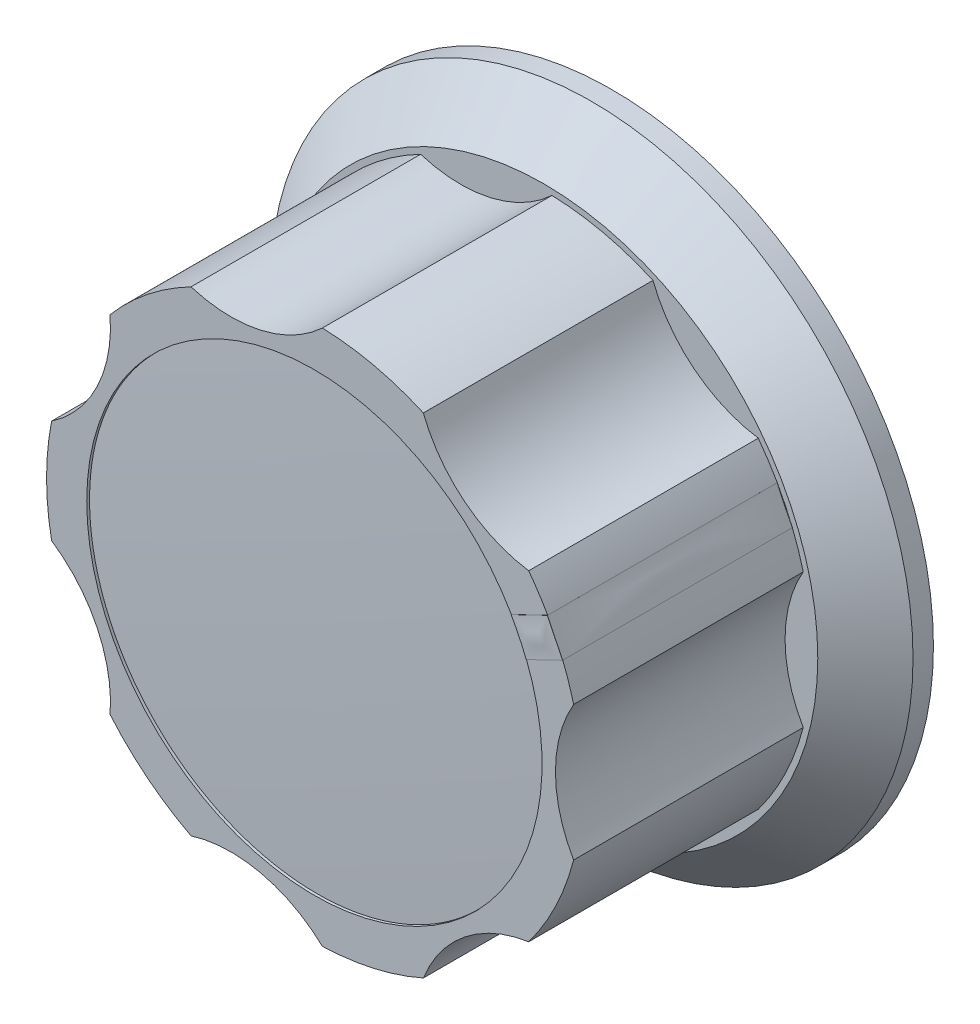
ISO-10303-21;
HEADER;
FILE_DESCRIPTION(('STEP AP214'),'2;1');
FILE_NAME('part.step','',(''),(''),'','','');
FILE_SCHEMA(('AUTOMOTIVE_DESIGN { 1 0 10303 214 1 1 1 1 }'));
ENDSEC;
DATA;
#1=APPLICATION_CONTEXT('core data for automotive mechanical design processes');
#2=APPLICATION_PROTOCOL_DEFINITION('international standard','automotive_design',2000,#1);
#3=PRODUCT_CONTEXT('',#1,'mechanical');
#4=PRODUCT('Part','Part','',(#3));
#5=PRODUCT_RELATED_PRODUCT_CATEGORY('part','',(#4));
#6=PRODUCT_DEFINITION_FORMATION('','',#4);
#7=PRODUCT_DEFINITION_CONTEXT('part definition',#1,'design');
#8=PRODUCT_DEFINITION('design','',#6,#7);
#9=PRODUCT_DEFINITION_SHAPE('','',#8);
#10=(LENGTH_UNIT() NAMED_UNIT(*) SI_UNIT(.MILLI.,.METRE.));
#11=(NAMED_UNIT(*) PLANE_ANGLE_UNIT() SI_UNIT($,.RADIAN.));
#12=(NAMED_UNIT(*) SI_UNIT($,.STERADIAN.) SOLID_ANGLE_UNIT());
#13=UNCERTAINTY_MEASURE_WITH_UNIT(LENGTH_MEASURE(1.E-05),#10,'distance_accuracy_value','');
#14=(GEOMETRIC_REPRESENTATION_CONTEXT(3) GLOBAL_UNCERTAINTY_ASSIGNED_CONTEXT((#13)) GLOBAL_UNIT_ASSIGNED_CONTEXT((#10,
#11,#12)) REPRESENTATION_CONTEXT('',''));
#15=CARTESIAN_POINT('',(0.,0.,0.));
#16=DIRECTION('',(0.,0.,1.));
#17=DIRECTION('',(1.,0.,0.));
#18=AXIS2_PLACEMENT_3D('',#15,#16,#17);
#19=CARTESIAN_POINT('',(8.70865108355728,4.91552004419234,11.1225));
#20=DIRECTION('',(-0.901009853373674,-0.433798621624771,0.));
#21=DIRECTION('',(0.433798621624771,-0.901009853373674,0.));
#22=AXIS2_PLACEMENT_3D('',#19,#20,#21);
#23=PLANE('',#22);
#24=DIRECTION('',(-0.433798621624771,0.901009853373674,0.));
#25=VECTOR('',#24,1.);
#26=CARTESIAN_POINT('',(8.70865108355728,4.91552004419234,11.1125));
#27=LINE('',#26,#25);
#28=CARTESIAN_POINT('',(9.27258929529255,3.74420722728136,11.1125));
#29=VERTEX_POINT('',#28);
#30=CARTESIAN_POINT('',(8.70865108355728,4.91552004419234,11.1125));
#31=VERTEX_POINT('',#30);
#32=EDGE_CURVE('E100',#29,#31,#27,.T.);
#33=ORIENTED_EDGE('',*,*,#32,.T.);
#34=DIRECTION('',(0.,0.,-1.));
#35=VECTOR('',#34,1.);
#36=CARTESIAN_POINT('',(8.70865108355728,4.91552004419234,11.1225));
#37=LINE('',#36,#35);
#38=CARTESIAN_POINT('',(8.70865108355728,4.91552004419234,11.1225));
#39=VERTEX_POINT('',#38);
#40=EDGE_CURVE('E12',#39,#31,#37,.T.);
#41=ORIENTED_EDGE('',*,*,#40,.F.);
#42=DIRECTION('',(-0.433798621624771,0.901009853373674,0.));
#43=VECTOR('',#42,1.);
#44=CARTESIAN_POINT('',(8.70865108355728,4.91552004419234,11.1225));
#45=LINE('',#44,#43);
#46=CARTESIAN_POINT('',(9.27258929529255,3.74420722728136,11.1225));
#47=VERTEX_POINT('',#46);
#48=EDGE_CURVE('E111',#47,#39,#45,.T.);
#49=ORIENTED_EDGE('',*,*,#48,.F.);
#50=DIRECTION('',(0.,0.,-1.));
#51=VECTOR('',#50,1.);
#52=CARTESIAN_POINT('',(9.27258929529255,3.74420722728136,11.1225));
#53=LINE('',#52,#51);
#54=EDGE_CURVE('E106',#47,#29,#53,.T.);
#55=ORIENTED_EDGE('',*,*,#54,.T.);
#56=EDGE_LOOP('',(#33,#41,#49,#55));
#57=FACE_BOUND('',#56,.T.);
#58=ADVANCED_FACE('F44',(#57),#23,.F.);
#59=CARTESIAN_POINT('',(7.35370589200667,4.26298131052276,11.1225));
#60=DIRECTION('',(0.433900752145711,-0.900960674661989,0.));
#61=DIRECTION('',(0.900960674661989,0.433900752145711,0.));
#62=AXIS2_PLACEMENT_3D('',#59,#60,#61);
#63=PLANE('',#62);
#64=DIRECTION('',(-0.900960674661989,-0.433900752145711,0.));
#65=VECTOR('',#64,1.);
#66=CARTESIAN_POINT('',(7.35370589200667,4.26298131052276,11.1125));
#67=LINE('',#66,#65);
#68=CARTESIAN_POINT('',(7.35370589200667,4.26298131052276,11.1125));
#69=VERTEX_POINT('',#68);
#70=EDGE_CURVE('E97',#31,#69,#67,.T.);
#71=ORIENTED_EDGE('',*,*,#70,.T.);
#72=DIRECTION('',(0.,0.,-1.));
#73=VECTOR('',#72,1.);
#74=CARTESIAN_POINT('',(7.35370589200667,4.26298131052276,11.1225));
#75=LINE('',#74,#73);
#76=CARTESIAN_POINT('',(7.35370589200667,4.26298131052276,11.1225));
#77=VERTEX_POINT('',#76);
#78=EDGE_CURVE('E56',#77,#69,#75,.T.);
#79=ORIENTED_EDGE('',*,*,#78,.F.);
#80=DIRECTION('',(-0.900960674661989,-0.433900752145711,0.));
#81=VECTOR('',#80,1.);
#82=CARTESIAN_POINT('',(7.35370589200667,4.26298131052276,11.1225));
#83=LINE('',#82,#81);
#84=EDGE_CURVE('E50',#39,#77,#83,.T.);
#85=ORIENTED_EDGE('',*,*,#84,.F.);
#86=ORIENTED_EDGE('',*,*,#40,.T.);
#87=EDGE_LOOP('',(#71,#79,#85,#86));
#88=FACE_BOUND('',#87,.T.);
#89=ADVANCED_FACE('F103',(#88),#63,.F.);
#90=CARTESIAN_POINT('',(0.,0.,11.1225));
#91=DIRECTION('',(0.,0.,-1.));
#92=DIRECTION('',(-1.,0.,0.));
#93=AXIS2_PLACEMENT_3D('',#90,#91,#92);
#94=CYLINDRICAL_SURFACE('',#93,8.5);
#95=CARTESIAN_POINT('',(0.,0.,11.1125));
#96=DIRECTION('',(0.,0.,-1.));
#97=DIRECTION('',(-1.,0.,0.));
#98=AXIS2_PLACEMENT_3D('',#95,#96,#97);
#99=CIRCLE('',#98,8.5);
#100=CARTESIAN_POINT('',(7.91777686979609,3.09173243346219,11.1125));
#101=VERTEX_POINT('',#100);
#102=EDGE_CURVE('E89',#69,#101,#99,.T.);
#103=ORIENTED_EDGE('',*,*,#102,.T.);
#104=DIRECTION('',(0.,0.,-1.));
#105=VECTOR('',#104,1.);
#106=CARTESIAN_POINT('',(7.91777686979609,3.09173243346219,11.1225));
#107=LINE('',#106,#105);
#108=CARTESIAN_POINT('',(7.91777686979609,3.09173243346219,11.1225));
#109=VERTEX_POINT('',#108);
#110=EDGE_CURVE('E113',#109,#101,#107,.T.);
#111=ORIENTED_EDGE('',*,*,#110,.F.);
#112=CARTESIAN_POINT('',(0.,0.,11.1225));
#113=DIRECTION('',(0.,0.,-1.));
#114=DIRECTION('',(-1.,0.,0.));
#115=AXIS2_PLACEMENT_3D('',#112,#113,#114);
#116=CIRCLE('',#115,8.5);
#117=EDGE_CURVE('E117',#77,#109,#116,.T.);
#118=ORIENTED_EDGE('',*,*,#117,.F.);
#119=ORIENTED_EDGE('',*,*,#78,.T.);
#120=EDGE_LOOP('',(#103,#111,#118,#119));
#121=FACE_BOUND('',#120,.T.);
#122=ADVANCED_FACE('F119',(#121),#94,.F.);
#123=CARTESIAN_POINT('',(7.91777686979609,3.09173243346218,11.1225));
#124=DIRECTION('',(-0.433900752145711,0.900960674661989,0.));
#125=DIRECTION('',(-0.900960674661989,-0.433900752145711,0.));
#126=AXIS2_PLACEMENT_3D('',#123,#124,#125);
#127=PLANE('',#126);
#128=DIRECTION('',(0.900960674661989,0.433900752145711,0.));
#129=VECTOR('',#128,1.);
#130=CARTESIAN_POINT('',(7.91777686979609,3.09173243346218,11.1125));
#131=LINE('',#130,#129);
#132=EDGE_CURVE('E81',#101,#29,#131,.T.);
#133=ORIENTED_EDGE('',*,*,#132,.T.);
#134=ORIENTED_EDGE('',*,*,#54,.F.);
#135=DIRECTION('',(0.900960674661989,0.433900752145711,0.));
#136=VECTOR('',#135,1.);
#137=CARTESIAN_POINT('',(7.91777686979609,3.09173243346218,11.1225));
#138=LINE('',#137,#136);
#139=EDGE_CURVE('E65',#109,#47,#138,.T.);
#140=ORIENTED_EDGE('',*,*,#139,.F.);
#141=ORIENTED_EDGE('',*,*,#110,.T.);
#142=EDGE_LOOP('',(#133,#134,#140,#141));
#143=FACE_BOUND('',#142,.T.);
#144=ADVANCED_FACE('F120',(#143),#127,.F.);
#145=CARTESIAN_POINT('',(8.70865108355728,4.91552004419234,11.1225));
#146=CARTESIAN_POINT('',(8.25700268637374,4.69800713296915,11.1225));
#147=CARTESIAN_POINT('',(7.80535428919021,4.48049422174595,11.1225));
#148=CARTESIAN_POINT('',(7.35370589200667,4.26298131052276,11.1225));
#149=CARTESIAN_POINT('',(8.89663048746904,4.52508243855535,11.1225));
#150=CARTESIAN_POINT('',(8.45663138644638,4.31333598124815,11.3000058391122));
#151=CARTESIAN_POINT('',(8.01491107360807,4.10076120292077,11.3005750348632));
#152=CARTESIAN_POINT('',(7.57145942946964,3.88735323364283,11.1225));
#153=CARTESIAN_POINT('',(9.0846098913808,4.13464483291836,11.1225));
#154=CARTESIAN_POINT('',(8.64474759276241,3.92265190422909,11.2997949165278));
#155=CARTESIAN_POINT('',(8.20316461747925,3.70982969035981,11.3009368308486));
#156=CARTESIAN_POINT('',(7.7598508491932,3.49617331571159,11.1225));
#157=CARTESIAN_POINT('',(9.27258929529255,3.74420722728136,11.1225));
#158=CARTESIAN_POINT('',(8.8209851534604,3.52671562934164,11.1225));
#159=CARTESIAN_POINT('',(8.36938101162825,3.30922403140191,11.1225));
#160=CARTESIAN_POINT('',(7.91777686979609,3.09173243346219,11.1225));
#161=(BOUNDED_SURFACE() B_SPLINE_SURFACE(3,3,((#145,#146,#147,#148),(#149,#150,#151,#152),(#153,
#154,#155,#156),(#157,#158,#159,#160)),.UNSPECIFIED.,.F.,.F.,
.F.) B_SPLINE_SURFACE_WITH_KNOTS((4,4),(4,4),(0.,1.),(0.,1.),
.UNSPECIFIED.) GEOMETRIC_REPRESENTATION_ITEM() RATIONAL_B_SPLINE_SURFACE(((1.,1.,1.,1.),(1.,1.,
0.99804789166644,0.99804789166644),(1.,1.,0.99804789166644,0.99804789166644),(1.,1.,1.,1.))) REPRESENTATION_ITEM('') SURFACE());
#162=ORIENTED_EDGE('',*,*,#48,.T.);
#163=ORIENTED_EDGE('',*,*,#84,.T.);
#164=ORIENTED_EDGE('',*,*,#117,.T.);
#165=ORIENTED_EDGE('',*,*,#139,.T.);
#166=EDGE_LOOP('',(#162,#163,#164,#165));
#167=FACE_BOUND('',#166,.T.);
#168=ADVANCED_FACE('F46',(#167),#161,.F.);
#169=CARTESIAN_POINT('',(0.,0.,11.1125));
#170=DIRECTION('',(0.,0.,-1.));
#171=DIRECTION('',(-1.,0.,0.));
#172=AXIS2_PLACEMENT_3D('',#169,#170,#171);
#173=PLANE('',#172);
#174=ORIENTED_EDGE('',*,*,#32,.F.);
#175=ORIENTED_EDGE('',*,*,#132,.F.);
#176=ORIENTED_EDGE('',*,*,#102,.F.);
#177=ORIENTED_EDGE('',*,*,#70,.F.);
#178=EDGE_LOOP('',(#174,#175,#176,#177));
#179=FACE_BOUND('',#178,.T.);
#180=ADVANCED_FACE('F98',(#179),#173,.T.);
#181=CLOSED_SHELL('',(#58,#89,#122,#144,#168,#180));
#182=MANIFOLD_SOLID_BREP('B2',#181);
#183=CARTESIAN_POINT('',(9.2727220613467,3.74427116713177,11.1125));
#184=DIRECTION('',(0.,0.,-1.));
#185=DIRECTION('',(-1.,0.,0.));
#186=AXIS2_PLACEMENT_3D('',#183,#184,#185);
#187=PLANE('',#186);
#188=DIRECTION('',(0.433900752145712,-0.900960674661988,0.));
#189=VECTOR('',#188,1.);
#190=CARTESIAN_POINT('',(8.83395421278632,3.5329615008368,11.1125));
#191=LINE('',#190,#189);
#192=CARTESIAN_POINT('',(8.26988323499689,4.70421037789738,11.1125));
#193=VERTEX_POINT('',#192);
#194=CARTESIAN_POINT('',(8.83395421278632,3.5329615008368,11.1125));
#195=VERTEX_POINT('',#194);
#196=EDGE_CURVE('E241',#193,#195,#191,.T.);
#197=ORIENTED_EDGE('',*,*,#196,.T.);
#198=DIRECTION('',(-0.900960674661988,-0.433900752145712,0.));
#199=VECTOR('',#198,1.);
#200=CARTESIAN_POINT('',(9.2727220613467,3.74427116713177,11.1125));
#201=LINE('',#200,#199);
#202=CARTESIAN_POINT('',(9.2727220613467,3.74427116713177,11.1125));
#203=VERTEX_POINT('',#202);
#204=EDGE_CURVE('E42',#203,#195,#201,.T.);
#205=ORIENTED_EDGE('',*,*,#204,.F.);
#206=DIRECTION('',(0.433900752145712,-0.900960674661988,0.));
#207=VECTOR('',#206,1.);
#208=CARTESIAN_POINT('',(9.2727220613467,3.74427116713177,11.1125));
#209=LINE('',#208,#207);
#210=CARTESIAN_POINT('',(8.70865108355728,4.91552004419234,11.1125));
#211=VERTEX_POINT('',#210);
#212=EDGE_CURVE('E252',#211,#203,#209,.T.);
#213=ORIENTED_EDGE('',*,*,#212,.F.);
#214=DIRECTION('',(-0.900960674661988,-0.433900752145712,0.));
#215=VECTOR('',#214,1.);
#216=CARTESIAN_POINT('',(8.70865108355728,4.91552004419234,11.1125));
#217=LINE('',#216,#215);
#218=EDGE_CURVE('E247',#211,#193,#217,.T.);
#219=ORIENTED_EDGE('',*,*,#218,.T.);
#220=EDGE_LOOP('',(#197,#205,#213,#219));
#221=FACE_BOUND('',#220,.T.);
#222=ADVANCED_FACE('F185',(#221),#187,.F.);
#223=CARTESIAN_POINT('',(9.2727220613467,3.74427116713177,2.54904443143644));
#224=DIRECTION('',(-0.433900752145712,0.900960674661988,0.));
#225=DIRECTION('',(-0.900960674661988,-0.433900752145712,0.));
#226=AXIS2_PLACEMENT_3D('',#223,#224,#225);
#227=PLANE('',#226);
#228=DIRECTION('',(0.,0.,-1.));
#229=VECTOR('',#228,1.);
#230=CARTESIAN_POINT('',(8.83395421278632,3.5329615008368,2.54904443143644));
#231=LINE('',#230,#229);
#232=CARTESIAN_POINT('',(8.83395421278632,3.5329615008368,2.54904443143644));
#233=VERTEX_POINT('',#232);
#234=EDGE_CURVE('E238',#195,#233,#231,.T.);
#235=ORIENTED_EDGE('',*,*,#234,.T.);
#236=DIRECTION('',(-0.900960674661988,-0.433900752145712,0.));
#237=VECTOR('',#236,1.);
#238=CARTESIAN_POINT('',(9.2727220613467,3.74427116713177,2.54904443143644));
#239=LINE('',#238,#237);
#240=CARTESIAN_POINT('',(9.2727220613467,3.74427116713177,2.54904443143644));
#241=VERTEX_POINT('',#240);
#242=EDGE_CURVE('E197',#241,#233,#239,.T.);
#243=ORIENTED_EDGE('',*,*,#242,.F.);
#244=DIRECTION('',(0.,0.,-1.));
#245=VECTOR('',#244,1.);
#246=CARTESIAN_POINT('',(9.2727220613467,3.74427116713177,2.54904443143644));
#247=LINE('',#246,#245);
#248=EDGE_CURVE('E191',#203,#241,#247,.T.);
#249=ORIENTED_EDGE('',*,*,#248,.F.);
#250=ORIENTED_EDGE('',*,*,#204,.T.);
#251=EDGE_LOOP('',(#235,#243,#249,#250));
#252=FACE_BOUND('',#251,.T.);
#253=ADVANCED_FACE('F244',(#252),#227,.F.);
#254=CARTESIAN_POINT('',(8.70865108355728,4.91552004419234,2.54904443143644));
#255=DIRECTION('',(0.,0.,1.));
#256=DIRECTION('',(1.,0.,0.));
#257=AXIS2_PLACEMENT_3D('',#254,#255,#256);
#258=PLANE('',#257);
#259=DIRECTION('',(-0.433900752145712,0.900960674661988,0.));
#260=VECTOR('',#259,1.);
#261=CARTESIAN_POINT('',(8.26988323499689,4.70421037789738,2.54904443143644));
#262=LINE('',#261,#260);
#263=CARTESIAN_POINT('',(8.26988323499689,4.70421037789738,2.54904443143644));
#264=VERTEX_POINT('',#263);
#265=EDGE_CURVE('E230',#233,#264,#262,.T.);
#266=ORIENTED_EDGE('',*,*,#265,.T.);
#267=DIRECTION('',(-0.900960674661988,-0.433900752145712,0.));
#268=VECTOR('',#267,1.);
#269=CARTESIAN_POINT('',(8.70865108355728,4.91552004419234,2.54904443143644));
#270=LINE('',#269,#268);
#271=CARTESIAN_POINT('',(8.70865108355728,4.91552004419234,2.54904443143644));
#272=VERTEX_POINT('',#271);
#273=EDGE_CURVE('E254',#272,#264,#270,.T.);
#274=ORIENTED_EDGE('',*,*,#273,.F.);
#275=DIRECTION('',(-0.433900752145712,0.900960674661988,0.));
#276=VECTOR('',#275,1.);
#277=CARTESIAN_POINT('',(8.70865108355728,4.91552004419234,2.54904443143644));
#278=LINE('',#277,#276);
#279=EDGE_CURVE('E258',#241,#272,#278,.T.);
#280=ORIENTED_EDGE('',*,*,#279,.F.);
#281=ORIENTED_EDGE('',*,*,#242,.T.);
#282=EDGE_LOOP('',(#266,#274,#280,#281));
#283=FACE_BOUND('',#282,.T.);
#284=ADVANCED_FACE('F260',(#283),#258,.F.);
#285=CARTESIAN_POINT('',(8.70865108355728,4.91552004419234,11.1125));
#286=DIRECTION('',(0.433900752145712,-0.900960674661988,0.));
#287=DIRECTION('',(0.900960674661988,0.433900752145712,0.));
#288=AXIS2_PLACEMENT_3D('',#285,#286,#287);
#289=PLANE('',#288);
#290=DIRECTION('',(0.,0.,1.));
#291=VECTOR('',#290,1.);
#292=CARTESIAN_POINT('',(8.26988323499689,4.70421037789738,11.1125));
#293=LINE('',#292,#291);
#294=EDGE_CURVE('E222',#264,#193,#293,.T.);
#295=ORIENTED_EDGE('',*,*,#294,.T.);
#296=ORIENTED_EDGE('',*,*,#218,.F.);
#297=DIRECTION('',(0.,0.,1.));
#298=VECTOR('',#297,1.);
#299=CARTESIAN_POINT('',(8.70865108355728,4.91552004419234,11.1125));
#300=LINE('',#299,#298);
#301=EDGE_CURVE('E206',#272,#211,#300,.T.);
#302=ORIENTED_EDGE('',*,*,#301,.F.);
#303=ORIENTED_EDGE('',*,*,#273,.T.);
#304=EDGE_LOOP('',(#295,#296,#302,#303));
#305=FACE_BOUND('',#304,.T.);
#306=ADVANCED_FACE('F261',(#305),#289,.F.);
#307=CARTESIAN_POINT('',(9.2727220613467,3.74427116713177,11.1125));
#308=CARTESIAN_POINT('',(9.2727220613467,3.74427116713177,8.25801481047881));
#309=CARTESIAN_POINT('',(9.2727220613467,3.74427116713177,5.40352962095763));
#310=CARTESIAN_POINT('',(9.2727220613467,3.74427116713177,2.54904443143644));
#311=CARTESIAN_POINT('',(9.08469840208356,4.13468745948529,11.1125));
#312=CARTESIAN_POINT('',(9.24486918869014,4.21182537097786,8.25801481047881));
#313=CARTESIAN_POINT('',(9.24486918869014,4.21182537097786,5.40352962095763));
#314=CARTESIAN_POINT('',(9.08469840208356,4.13468745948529,2.54904443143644));
#315=CARTESIAN_POINT('',(8.89667474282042,4.52510375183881,11.1125));
#316=CARTESIAN_POINT('',(9.056845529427,4.60224166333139,8.25801481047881));
#317=CARTESIAN_POINT('',(9.056845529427,4.60224166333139,5.40352962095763));
#318=CARTESIAN_POINT('',(8.89667474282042,4.52510375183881,2.54904443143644));
#319=CARTESIAN_POINT('',(8.70865108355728,4.91552004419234,11.1125));
#320=CARTESIAN_POINT('',(8.70865108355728,4.91552004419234,8.25801481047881));
#321=CARTESIAN_POINT('',(8.70865108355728,4.91552004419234,5.40352962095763));
#322=CARTESIAN_POINT('',(8.70865108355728,4.91552004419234,2.54904443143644));
#323=B_SPLINE_SURFACE_WITH_KNOTS('',3,3,((#307,#308,#309,#310),(#311,#312,#313,#314),(#315,#316,
#317,#318),(#319,#320,#321,#322)),.UNSPECIFIED.,.F.,.F.,.F.,(4,4),(4,4),(0.,1.),(0.,1.),.UNSPECIFIED.);
#324=ORIENTED_EDGE('',*,*,#212,.T.);
#325=ORIENTED_EDGE('',*,*,#248,.T.);
#326=ORIENTED_EDGE('',*,*,#279,.T.);
#327=ORIENTED_EDGE('',*,*,#301,.T.);
#328=EDGE_LOOP('',(#324,#325,#326,#327));
#329=FACE_BOUND('',#328,.T.);
#330=ADVANCED_FACE('F187',(#329),#323,.F.);
#331=CARTESIAN_POINT('',(8.26988323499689,4.70421037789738,11.1125));
#332=DIRECTION('',(-0.900960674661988,-0.433900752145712,0.));
#333=DIRECTION('',(0.433900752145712,-0.900960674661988,0.));
#334=AXIS2_PLACEMENT_3D('',#331,#332,#333);
#335=PLANE('',#334);
#336=ORIENTED_EDGE('',*,*,#196,.F.);
#337=ORIENTED_EDGE('',*,*,#294,.F.);
#338=ORIENTED_EDGE('',*,*,#265,.F.);
#339=ORIENTED_EDGE('',*,*,#234,.F.);
#340=EDGE_LOOP('',(#336,#337,#338,#339));
#341=FACE_BOUND('',#340,.T.);
#342=ADVANCED_FACE('F239',(#341),#335,.T.);
#343=CLOSED_SHELL('',(#222,#253,#284,#306,#330,#342));
#344=MANIFOLD_SOLID_BREP('B6',#343);
#345=CARTESIAN_POINT('',(7.91777686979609,3.09173243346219,11.1125));
#346=DIRECTION('',(-0.433900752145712,0.900960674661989,0.));
#347=DIRECTION('',(-0.900960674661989,-0.433900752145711,0.));
#348=AXIS2_PLACEMENT_3D('',#345,#346,#347);
#349=PLANE('',#348);
#350=DIRECTION('',(0.,0.,-1.));
#351=VECTOR('',#350,1.);
#352=CARTESIAN_POINT('',(8.83395421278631,3.5329615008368,11.1125));
#353=LINE('',#352,#351);
#354=CARTESIAN_POINT('',(8.83395421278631,3.5329615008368,11.1125));
#355=VERTEX_POINT('',#354);
#356=CARTESIAN_POINT('',(8.83395421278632,3.5329615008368,10.6045));
#357=VERTEX_POINT('',#356);
#358=EDGE_CURVE('E343',#355,#357,#353,.T.);
#359=ORIENTED_EDGE('',*,*,#358,.F.);
#360=DIRECTION('',(0.900960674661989,0.433900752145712,0.));
#361=VECTOR('',#360,1.);
#362=CARTESIAN_POINT('',(7.91777686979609,3.09173243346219,11.1125));
#363=LINE('',#362,#361);
#364=CARTESIAN_POINT('',(7.91777686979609,3.09173243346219,11.1125));
#365=VERTEX_POINT('',#364);
#366=EDGE_CURVE('E392',#365,#355,#363,.T.);
#367=ORIENTED_EDGE('',*,*,#366,.F.);
#368=DIRECTION('',(0.,0.,-1.));
#369=VECTOR('',#368,1.);
#370=CARTESIAN_POINT('',(7.91777686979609,3.09173243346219,11.1125));
#371=LINE('',#370,#369);
#372=CARTESIAN_POINT('',(7.91777686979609,3.09173243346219,10.6045));
#373=VERTEX_POINT('',#372);
#374=EDGE_CURVE('E336',#365,#373,#371,.T.);
#375=ORIENTED_EDGE('',*,*,#374,.T.);
#376=DIRECTION('',(0.900960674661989,0.433900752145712,0.));
#377=VECTOR('',#376,1.);
#378=CARTESIAN_POINT('',(7.91777686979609,3.09173243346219,10.6045));
#379=LINE('',#378,#377);
#380=EDGE_CURVE('E375',#373,#357,#379,.T.);
#381=ORIENTED_EDGE('',*,*,#380,.T.);
#382=EDGE_LOOP('',(#359,#367,#375,#381));
#383=FACE_BOUND('',#382,.T.);
#384=ADVANCED_FACE('F328',(#383),#349,.F.);
#385=CARTESIAN_POINT('',(7.35370589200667,4.26298131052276,11.1125));
#386=DIRECTION('',(0.433900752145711,-0.900960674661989,0.));
#387=DIRECTION('',(0.900960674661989,0.433900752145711,0.));
#388=AXIS2_PLACEMENT_3D('',#385,#386,#387);
#389=PLANE('',#388);
#390=DIRECTION('',(0.,0.,1.));
#391=VECTOR('',#390,1.);
#392=CARTESIAN_POINT('',(8.26988323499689,4.70421037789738,11.1125));
#393=LINE('',#392,#391);
#394=CARTESIAN_POINT('',(8.26988323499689,4.70421037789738,10.6045));
#395=VERTEX_POINT('',#394);
#396=CARTESIAN_POINT('',(8.26988323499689,4.70421037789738,11.1125));
#397=VERTEX_POINT('',#396);
#398=EDGE_CURVE('E371',#395,#397,#393,.T.);
#399=ORIENTED_EDGE('',*,*,#398,.F.);
#400=DIRECTION('',(-0.900960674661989,-0.433900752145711,0.));
#401=VECTOR('',#400,1.);
#402=CARTESIAN_POINT('',(7.35370589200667,4.26298131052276,10.6045));
#403=LINE('',#402,#401);
#404=CARTESIAN_POINT('',(7.35370589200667,4.26298131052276,10.6045));
#405=VERTEX_POINT('',#404);
#406=EDGE_CURVE('E365',#395,#405,#403,.T.);
#407=ORIENTED_EDGE('',*,*,#406,.T.);
#408=DIRECTION('',(0.,0.,-1.));
#409=VECTOR('',#408,1.);
#410=CARTESIAN_POINT('',(7.35370589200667,4.26298131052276,11.1125));
#411=LINE('',#410,#409);
#412=CARTESIAN_POINT('',(7.35370589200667,4.26298131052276,11.1125));
#413=VERTEX_POINT('',#412);
#414=EDGE_CURVE('E368',#413,#405,#411,.T.);
#415=ORIENTED_EDGE('',*,*,#414,.F.);
#416=DIRECTION('',(-0.900960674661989,-0.433900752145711,0.));
#417=VECTOR('',#416,1.);
#418=CARTESIAN_POINT('',(7.35370589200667,4.26298131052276,11.1125));
#419=LINE('',#418,#417);
#420=EDGE_CURVE('E351',#397,#413,#419,.T.);
#421=ORIENTED_EDGE('',*,*,#420,.F.);
#422=EDGE_LOOP('',(#399,#407,#415,#421));
#423=FACE_BOUND('',#422,.T.);
#424=ADVANCED_FACE('F367',(#423),#389,.F.);
#425=CARTESIAN_POINT('',(0.,0.,11.1125));
#426=DIRECTION('',(0.,0.,-1.));
#427=DIRECTION('',(-1.,0.,0.));
#428=AXIS2_PLACEMENT_3D('',#425,#426,#427);
#429=PLANE('',#428);
#430=DIRECTION('',(0.433900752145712,-0.900960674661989,0.));
#431=VECTOR('',#430,1.);
#432=CARTESIAN_POINT('',(8.26988323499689,4.70421037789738,11.1125));
#433=LINE('',#432,#431);
#434=EDGE_CURVE('E398',#397,#355,#433,.T.);
#435=ORIENTED_EDGE('',*,*,#434,.F.);
#436=ORIENTED_EDGE('',*,*,#420,.T.);
#437=CARTESIAN_POINT('',(0.,0.,11.1125));
#438=DIRECTION('',(0.,0.,-1.));
#439=DIRECTION('',(-1.,0.,0.));
#440=AXIS2_PLACEMENT_3D('',#437,#438,#439);
#441=CIRCLE('',#440,8.5);
#442=EDGE_CURVE('E374',#413,#365,#441,.T.);
#443=ORIENTED_EDGE('',*,*,#442,.T.);
#444=ORIENTED_EDGE('',*,*,#366,.T.);
#445=EDGE_LOOP('',(#435,#436,#443,#444));
#446=FACE_BOUND('',#445,.T.);
#447=ADVANCED_FACE('F394',(#446),#429,.F.);
#448=CARTESIAN_POINT('',(0.,0.,10.6045));
#449=DIRECTION('',(0.,0.,-1.));
#450=DIRECTION('',(-1.,0.,0.));
#451=AXIS2_PLACEMENT_3D('',#448,#449,#450);
#452=PLANE('',#451);
#453=ORIENTED_EDGE('',*,*,#406,.F.);
#454=DIRECTION('',(0.433900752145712,-0.900960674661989,0.));
#455=VECTOR('',#454,1.);
#456=CARTESIAN_POINT('',(8.5519187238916,4.1185859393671,10.6045));
#457=LINE('',#456,#455);
#458=EDGE_CURVE('E183',#395,#357,#457,.T.);
#459=ORIENTED_EDGE('',*,*,#458,.T.);
#460=ORIENTED_EDGE('',*,*,#380,.F.);
#461=CARTESIAN_POINT('',(0.,0.,10.6045));
#462=DIRECTION('',(0.,0.,-1.));
#463=DIRECTION('',(-1.,0.,0.));
#464=AXIS2_PLACEMENT_3D('',#461,#462,#463);
#465=CIRCLE('',#464,8.5);
#466=EDGE_CURVE('E380',#405,#373,#465,.T.);
#467=ORIENTED_EDGE('',*,*,#466,.F.);
#468=EDGE_LOOP('',(#453,#459,#460,#467));
#469=FACE_BOUND('',#468,.T.);
#470=ADVANCED_FACE('F382',(#469),#452,.T.);
#471=CARTESIAN_POINT('',(0.,0.,11.1125));
#472=DIRECTION('',(0.,0.,-1.));
#473=DIRECTION('',(-1.,0.,0.));
#474=AXIS2_PLACEMENT_3D('',#471,#472,#473);
#475=CYLINDRICAL_SURFACE('',#474,8.5);
#476=ORIENTED_EDGE('',*,*,#466,.T.);
#477=ORIENTED_EDGE('',*,*,#374,.F.);
#478=ORIENTED_EDGE('',*,*,#442,.F.);
#479=ORIENTED_EDGE('',*,*,#414,.T.);
#480=EDGE_LOOP('',(#476,#477,#478,#479));
#481=FACE_BOUND('',#480,.T.);
#482=ADVANCED_FACE('F330',(#481),#475,.F.);
#483=CARTESIAN_POINT('',(8.83395421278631,3.5329615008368,11.1125));
#484=DIRECTION('',(0.900960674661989,0.433900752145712,0.));
#485=DIRECTION('',(-0.433900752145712,0.900960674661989,0.));
#486=AXIS2_PLACEMENT_3D('',#483,#484,#485);
#487=PLANE('',#486);
#488=ORIENTED_EDGE('',*,*,#398,.T.);
#489=ORIENTED_EDGE('',*,*,#434,.T.);
#490=ORIENTED_EDGE('',*,*,#358,.T.);
#491=ORIENTED_EDGE('',*,*,#458,.F.);
#492=EDGE_LOOP('',(#488,#489,#490,#491));
#493=FACE_BOUND('',#492,.T.);
#494=ADVANCED_FACE('F399',(#493),#487,.T.);
#495=CLOSED_SHELL('',(#384,#424,#447,#470,#482,#494));
#496=MANIFOLD_SOLID_BREP('B36',#495);
#497=CARTESIAN_POINT('',(0.,0.,11.0125));
#498=DIRECTION('',(0.,0.,-1.));
#499=DIRECTION('',(-1.,0.,0.));
#500=AXIS2_PLACEMENT_3D('',#497,#498,#499);
#501=CYLINDRICAL_SURFACE('',#500,8.5);
#502=CARTESIAN_POINT('',(0.,0.,11.0125));
#503=DIRECTION('',(0.,0.,1.));
#504=DIRECTION('',(1.,0.,0.));
#505=AXIS2_PLACEMENT_3D('',#502,#503,#504);
#506=CIRCLE('',#505,8.5);
#507=CARTESIAN_POINT('',(8.5,0.,11.0125));
#508=VERTEX_POINT('',#507);
#509=EDGE_CURVE('E327',#508,#508,#506,.T.);
#510=ORIENTED_EDGE('',*,*,#509,.F.);
#511=EDGE_LOOP('',(#510));
#512=FACE_BOUND('',#511,.T.);
#513=CARTESIAN_POINT('',(0.,0.,10.6045));
#514=DIRECTION('',(0.,0.,1.));
#515=DIRECTION('',(1.,0.,0.));
#516=AXIS2_PLACEMENT_3D('',#513,#514,#515);
#517=CIRCLE('',#516,8.5);
#518=CARTESIAN_POINT('',(8.5,0.,10.6045));
#519=VERTEX_POINT('',#518);
#520=EDGE_CURVE('E472',#519,#519,#517,.T.);
#521=ORIENTED_EDGE('',*,*,#520,.T.);
#522=EDGE_LOOP('',(#521));
#523=FACE_BOUND('',#522,.T.);
#524=ADVANCED_FACE('F465',(#512,#523),#501,.T.);
#525=CARTESIAN_POINT('',(0.,0.,-229.745833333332));
#526=DIRECTION('',(0.,0.,1.));
#527=DIRECTION('',(1.,0.,0.));
#528=AXIS2_PLACEMENT_3D('',#525,#526,#527);
#529=SPHERICAL_SURFACE('',#528,240.908333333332);
#530=ORIENTED_EDGE('',*,*,#509,.T.);
#531=EDGE_LOOP('',(#530));
#532=FACE_BOUND('',#531,.T.);
#533=ADVANCED_FACE('F467',(#532),#529,.T.);
#534=CARTESIAN_POINT('',(0.,0.,10.6045));
#535=DIRECTION('',(0.,0.,1.));
#536=DIRECTION('',(1.,0.,0.));
#537=AXIS2_PLACEMENT_3D('',#534,#535,#536);
#538=PLANE('',#537);
#539=ORIENTED_EDGE('',*,*,#520,.F.);
#540=EDGE_LOOP('',(#539));
#541=FACE_BOUND('',#540,.T.);
#542=ADVANCED_FACE('F479',(#541),#538,.F.);
#543=CLOSED_SHELL('',(#524,#533,#542));
#544=MANIFOLD_SOLID_BREP('B177',#543);
#545=CARTESIAN_POINT('',(0.,0.,10.6045));
#546=DIRECTION('',(0.,0.,1.));
#547=DIRECTION('',(1.,0.,0.));
#548=AXIS2_PLACEMENT_3D('',#545,#546,#547);
#549=PLANE('',#548);
#550=DIRECTION('',(0.900960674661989,0.433900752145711,0.));
#551=VECTOR('',#550,1.);
#552=CARTESIAN_POINT('',(7.91777686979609,3.09173243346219,10.6045));
#553=LINE('',#552,#551);
#554=CARTESIAN_POINT('',(7.91777686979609,3.09173243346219,10.6045));
#555=VERTEX_POINT('',#554);
#556=CARTESIAN_POINT('',(8.83395421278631,3.5329615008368,10.6045));
#557=VERTEX_POINT('',#556);
#558=EDGE_CURVE('E669',#555,#557,#553,.T.);
#559=ORIENTED_EDGE('',*,*,#558,.T.);
#560=DIRECTION('',(-0.433900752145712,0.900960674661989,0.));
#561=VECTOR('',#560,1.);
#562=CARTESIAN_POINT('',(8.5519187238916,4.1185859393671,10.6045));
#563=LINE('',#562,#561);
#564=CARTESIAN_POINT('',(8.26988323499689,4.70421037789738,10.6045));
#565=VERTEX_POINT('',#564);
#566=EDGE_CURVE('E514',#557,#565,#563,.T.);
#567=ORIENTED_EDGE('',*,*,#566,.T.);
#568=DIRECTION('',(-0.900960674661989,-0.43390075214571,0.));
#569=VECTOR('',#568,1.);
#570=CARTESIAN_POINT('',(7.35370589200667,4.26298131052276,10.6045));
#571=LINE('',#570,#569);
#572=CARTESIAN_POINT('',(7.35370589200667,4.26298131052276,10.6045));
#573=VERTEX_POINT('',#572);
#574=EDGE_CURVE('E672',#565,#573,#571,.T.);
#575=ORIENTED_EDGE('',*,*,#574,.T.);
#576=CARTESIAN_POINT('',(0.,0.,10.6045));
#577=DIRECTION('',(0.,0.,1.));
#578=DIRECTION('',(1.,0.,0.));
#579=AXIS2_PLACEMENT_3D('',#576,#577,#578);
#580=CIRCLE('',#579,8.5);
#581=EDGE_CURVE('E666',#573,#555,#580,.T.);
#582=ORIENTED_EDGE('',*,*,#581,.T.);
#583=EDGE_LOOP('',(#559,#567,#575,#582));
#584=FACE_BOUND('',#583,.T.);
#585=ADVANCED_FACE('F506',(#584),#549,.T.);
#586=CARTESIAN_POINT('',(0.,0.,2.54));
#587=DIRECTION('',(0.,0.,1.));
#588=DIRECTION('',(1.,0.,0.));
#589=AXIS2_PLACEMENT_3D('',#586,#587,#588);
#590=PLANE('',#589);
#591=CARTESIAN_POINT('',(0.,0.,2.54));
#592=DIRECTION('',(0.,0.,1.));
#593=DIRECTION('',(1.,0.,0.));
#594=AXIS2_PLACEMENT_3D('',#591,#592,#593);
#595=CIRCLE('',#594,10.222);
#596=CARTESIAN_POINT('',(10.222,0.,2.54));
#597=VERTEX_POINT('',#596);
#598=EDGE_CURVE('E789',#597,#597,#595,.T.);
#599=ORIENTED_EDGE('',*,*,#598,.T.);
#600=EDGE_LOOP('',(#599));
#601=FACE_BOUND('',#600,.T.);
#602=CARTESIAN_POINT('',(0.,0.,2.54));
#603=DIRECTION('',(0.,0.,1.));
#604=DIRECTION('',(-1.,0.,0.));
#605=AXIS2_PLACEMENT_3D('',#602,#603,#604);
#606=CIRCLE('',#605,10.);
#607=CARTESIAN_POINT('',(4.06783472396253,9.13524606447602,2.54));
#608=VERTEX_POINT('',#607);
#609=CARTESIAN_POINT('',(0.297601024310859,9.99557070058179,2.54));
#610=VERTEX_POINT('',#609);
#611=EDGE_CURVE('E721',#608,#610,#606,.T.);
#612=ORIENTED_EDGE('',*,*,#611,.F.);
#613=CARTESIAN_POINT('',(8.72844384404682,10.9459704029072,2.54));
#614=DIRECTION('',(0.,0.,-1.));
#615=DIRECTION('',(1.,0.,0.));
#616=AXIS2_PLACEMENT_3D('',#613,#614,#615);
#617=CIRCLE('',#616,5.);
#618=CARTESIAN_POINT('',(8.00057487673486,5.99923342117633,2.54));
#619=VERTEX_POINT('',#618);
#620=EDGE_CURVE('E681',#619,#608,#617,.T.);
#621=ORIENTED_EDGE('',*,*,#620,.F.);
#622=CARTESIAN_POINT('',(0.,0.,2.54));
#623=DIRECTION('',(0.,0.,1.));
#624=DIRECTION('',(-1.,0.,0.));
#625=AXIS2_PLACEMENT_3D('',#622,#623,#624);
#626=CIRCLE('',#625,10.);
#627=CARTESIAN_POINT('',(9.67857142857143,2.51500598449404,2.54));
#628=VERTEX_POINT('',#627);
#629=EDGE_CURVE('E690',#628,#619,#626,.T.);
#630=ORIENTED_EDGE('',*,*,#629,.F.);
#631=CARTESIAN_POINT('',(14.,0.,2.54));
#632=DIRECTION('',(0.,0.,-1.));
#633=DIRECTION('',(1.,0.,0.));
#634=AXIS2_PLACEMENT_3D('',#631,#632,#633);
#635=CIRCLE('',#634,5.);
#636=CARTESIAN_POINT('',(9.67857142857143,-2.51500598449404,2.54));
#637=VERTEX_POINT('',#636);
#638=EDGE_CURVE('E743',#637,#628,#635,.T.);
#639=ORIENTED_EDGE('',*,*,#638,.F.);
#640=CARTESIAN_POINT('',(0.,0.,2.54));
#641=DIRECTION('',(0.,0.,1.));
#642=DIRECTION('',(1.,0.,0.));
#643=AXIS2_PLACEMENT_3D('',#640,#641,#642);
#644=CIRCLE('',#643,10.);
#645=CARTESIAN_POINT('',(8.00154822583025,-5.99793514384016,2.54));
#646=VERTEX_POINT('',#645);
#647=EDGE_CURVE('E741',#646,#637,#644,.T.);
#648=ORIENTED_EDGE('',*,*,#647,.F.);
#649=CARTESIAN_POINT('',(8.73021985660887,-10.9445539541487,2.54));
#650=DIRECTION('',(0.,0.,-1.));
#651=DIRECTION('',(-1.,0.,0.));
#652=AXIS2_PLACEMENT_3D('',#649,#650,#651);
#653=CIRCLE('',#652,5.);
#654=CARTESIAN_POINT('',(4.06931698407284,-9.13458588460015,2.54));
#655=VERTEX_POINT('',#654);
#656=EDGE_CURVE('E739',#655,#646,#653,.T.);
#657=ORIENTED_EDGE('',*,*,#656,.F.);
#658=CARTESIAN_POINT('',(0.,0.,2.54));
#659=DIRECTION('',(0.,0.,1.));
#660=DIRECTION('',(1.,0.,0.));
#661=AXIS2_PLACEMENT_3D('',#658,#659,#660);
#662=CIRCLE('',#661,10.);
#663=CARTESIAN_POINT('',(0.297601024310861,-9.99557070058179,2.54));
#664=VERTEX_POINT('',#663);
#665=EDGE_CURVE('E737',#664,#655,#662,.T.);
#666=ORIENTED_EDGE('',*,*,#665,.F.);
#667=CARTESIAN_POINT('',(-3.11619943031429,-13.648783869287,2.54));
#668=DIRECTION('',(0.,0.,-1.));
#669=DIRECTION('',(1.,0.,0.));
#670=AXIS2_PLACEMENT_3D('',#667,#668,#669);
#671=CIRCLE('',#670,5.);
#672=CARTESIAN_POINT('',(-4.60622370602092,-8.87596209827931,2.54));
#673=VERTEX_POINT('',#672);
#674=EDGE_CURVE('E735',#673,#664,#671,.T.);
#675=ORIENTED_EDGE('',*,*,#674,.F.);
#676=CARTESIAN_POINT('',(0.,0.,2.54));
#677=DIRECTION('',(0.,0.,1.));
#678=DIRECTION('',(1.,0.,0.));
#679=AXIS2_PLACEMENT_3D('',#676,#677,#678);
#680=CIRCLE('',#679,10.);
#681=CARTESIAN_POINT('',(-7.62805103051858,-6.46628467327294,2.54));
#682=VERTEX_POINT('',#681);
#683=EDGE_CURVE('E733',#682,#673,#680,.T.);
#684=ORIENTED_EDGE('',*,*,#683,.F.);
#685=CARTESIAN_POINT('',(-12.612793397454,-6.07597257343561,2.54));
#686=DIRECTION('',(0.,0.,-1.));
#687=DIRECTION('',(1.,0.,0.));
#688=AXIS2_PLACEMENT_3D('',#685,#686,#687);
#689=CIRCLE('',#688,5.);
#690=CARTESIAN_POINT('',(-9.81106637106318,-1.93467740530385,2.54));
#691=VERTEX_POINT('',#690);
#692=EDGE_CURVE('E731',#691,#682,#689,.T.);
#693=ORIENTED_EDGE('',*,*,#692,.F.);
#694=CARTESIAN_POINT('',(0.,0.,2.54));
#695=DIRECTION('',(0.,0.,1.));
#696=DIRECTION('',(1.,0.,0.));
#697=AXIS2_PLACEMENT_3D('',#694,#695,#696);
#698=CIRCLE('',#697,10.);
#699=CARTESIAN_POINT('',(-9.81150041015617,1.93247501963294,2.54));
#700=VERTEX_POINT('',#699);
#701=EDGE_CURVE('E729',#700,#691,#698,.T.);
#702=ORIENTED_EDGE('',*,*,#701,.F.);
#703=CARTESIAN_POINT('',(-12.6141569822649,6.07314116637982,2.54));
#704=DIRECTION('',(0.,0.,-1.));
#705=DIRECTION('',(1.,0.,0.));
#706=AXIS2_PLACEMENT_3D('',#703,#704,#705);
#707=CIRCLE('',#706,5.);
#708=CARTESIAN_POINT('',(-7.62950235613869,6.46457220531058,2.54));
#709=VERTEX_POINT('',#708);
#710=EDGE_CURVE('E727',#709,#700,#707,.T.);
#711=ORIENTED_EDGE('',*,*,#710,.F.);
#712=CARTESIAN_POINT('',(0.,0.,2.54));
#713=DIRECTION('',(0.,0.,1.));
#714=DIRECTION('',(1.,0.,0.));
#715=AXIS2_PLACEMENT_3D('',#712,#713,#714);
#716=CIRCLE('',#715,10.);
#717=CARTESIAN_POINT('',(-4.60622370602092,8.87596209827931,2.54));
#718=VERTEX_POINT('',#717);
#719=EDGE_CURVE('E725',#718,#709,#716,.T.);
#720=ORIENTED_EDGE('',*,*,#719,.F.);
#721=CARTESIAN_POINT('',(-3.11619943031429,13.648783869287,2.54));
#722=DIRECTION('',(0.,0.,-1.));
#723=DIRECTION('',(1.,0.,0.));
#724=AXIS2_PLACEMENT_3D('',#721,#722,#723);
#725=CIRCLE('',#724,5.);
#726=EDGE_CURVE('E723',#610,#718,#725,.T.);
#727=ORIENTED_EDGE('',*,*,#726,.F.);
#728=EDGE_LOOP('',(#612,#621,#630,#639,#648,#657,#666,#675,#684,#693,#702,#711,#720,#727));
#729=FACE_BOUND('',#728,.T.);
#730=ADVANCED_FACE('F877',(#601,#729),#590,.T.);
#731=CARTESIAN_POINT('',(0.,0.,2.54));
#732=DIRECTION('',(0.,0.,-1.));
#733=DIRECTION('',(-1.,0.,0.));
#734=AXIS2_PLACEMENT_3D('',#731,#732,#733);
#735=CYLINDRICAL_SURFACE('',#734,12.);
#736=CARTESIAN_POINT('',(0.,0.,0.761999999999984));
#737=DIRECTION('',(0.,0.,1.));
#738=DIRECTION('',(1.,0.,0.));
#739=AXIS2_PLACEMENT_3D('',#736,#737,#738);
#740=CIRCLE('',#739,12.);
#741=CARTESIAN_POINT('',(12.,0.,0.761999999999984));
#742=VERTEX_POINT('',#741);
#743=EDGE_CURVE('E792',#742,#742,#740,.F.);
#744=ORIENTED_EDGE('',*,*,#743,.T.);
#745=EDGE_LOOP('',(#744));
#746=FACE_BOUND('',#745,.T.);
#747=CARTESIAN_POINT('',(0.,0.,0.));
#748=DIRECTION('',(0.,0.,1.));
#749=DIRECTION('',(1.,0.,0.));
#750=AXIS2_PLACEMENT_3D('',#747,#748,#749);
#751=CIRCLE('',#750,12.);
#752=CARTESIAN_POINT('',(12.,0.,0.));
#753=VERTEX_POINT('',#752);
#754=EDGE_CURVE('E786',#753,#753,#751,.T.);
#755=ORIENTED_EDGE('',*,*,#754,.T.);
#756=EDGE_LOOP('',(#755));
#757=FACE_BOUND('',#756,.T.);
#758=ADVANCED_FACE('F879',(#746,#757),#735,.T.);
#759=CARTESIAN_POINT('',(0.,0.,0.));
#760=DIRECTION('',(0.,0.,1.));
#761=DIRECTION('',(1.,0.,0.));
#762=AXIS2_PLACEMENT_3D('',#759,#760,#761);
#763=PLANE('',#762);
#764=ORIENTED_EDGE('',*,*,#754,.F.);
#765=EDGE_LOOP('',(#764));
#766=FACE_BOUND('',#765,.T.);
#767=ADVANCED_FACE('F886',(#766),#763,.F.);
#768=CARTESIAN_POINT('',(8.72844384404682,10.9459704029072,11.1125));
#769=DIRECTION('',(0.,0.,-1.));
#770=DIRECTION('',(-1.,0.,0.));
#771=AXIS2_PLACEMENT_3D('',#768,#769,#770);
#772=CYLINDRICAL_SURFACE('',#771,5.);
#773=ORIENTED_EDGE('',*,*,#620,.T.);
#774=DIRECTION('',(0.,0.,-1.));
#775=VECTOR('',#774,1.);
#776=CARTESIAN_POINT('',(4.06783472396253,9.13524606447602,11.1125));
#777=LINE('',#776,#775);
#778=CARTESIAN_POINT('',(4.06783472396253,9.13524606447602,11.1125));
#779=VERTEX_POINT('',#778);
#780=EDGE_CURVE('E784',#779,#608,#777,.T.);
#781=ORIENTED_EDGE('',*,*,#780,.F.);
#782=CARTESIAN_POINT('',(8.72844384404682,10.9459704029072,11.1125));
#783=DIRECTION('',(0.,0.,-1.));
#784=DIRECTION('',(1.,0.,0.));
#785=AXIS2_PLACEMENT_3D('',#782,#783,#784);
#786=CIRCLE('',#785,5.);
#787=CARTESIAN_POINT('',(8.00057487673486,5.99923342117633,11.1125));
#788=VERTEX_POINT('',#787);
#789=EDGE_CURVE('E686',#788,#779,#786,.T.);
#790=ORIENTED_EDGE('',*,*,#789,.F.);
#791=DIRECTION('',(0.,0.,-1.));
#792=VECTOR('',#791,1.);
#793=CARTESIAN_POINT('',(8.00057487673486,5.99923342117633,11.1125));
#794=LINE('',#793,#792);
#795=EDGE_CURVE('E718',#788,#619,#794,.T.);
#796=ORIENTED_EDGE('',*,*,#795,.T.);
#797=EDGE_LOOP('',(#773,#781,#790,#796));
#798=FACE_BOUND('',#797,.T.);
#799=ADVANCED_FACE('F818',(#798),#772,.F.);
#800=CARTESIAN_POINT('',(0.,0.,11.1125));
#801=DIRECTION('',(0.,0.,-1.));
#802=DIRECTION('',(-1.,0.,0.));
#803=AXIS2_PLACEMENT_3D('',#800,#801,#802);
#804=CYLINDRICAL_SURFACE('',#803,10.);
#805=ORIENTED_EDGE('',*,*,#611,.T.);
#806=DIRECTION('',(0.,0.,-1.));
#807=VECTOR('',#806,1.);
#808=CARTESIAN_POINT('',(0.297601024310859,9.99557070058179,11.1125));
#809=LINE('',#808,#807);
#810=CARTESIAN_POINT('',(0.297601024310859,9.99557070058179,11.1125));
#811=VERTEX_POINT('',#810);
#812=EDGE_CURVE('E781',#811,#610,#809,.T.);
#813=ORIENTED_EDGE('',*,*,#812,.F.);
#814=CARTESIAN_POINT('',(0.,0.,11.1125));
#815=DIRECTION('',(0.,0.,1.));
#816=DIRECTION('',(-1.,0.,0.));
#817=AXIS2_PLACEMENT_3D('',#814,#815,#816);
#818=CIRCLE('',#817,10.);
#819=EDGE_CURVE('E689',#779,#811,#818,.T.);
#820=ORIENTED_EDGE('',*,*,#819,.F.);
#821=ORIENTED_EDGE('',*,*,#780,.T.);
#822=EDGE_LOOP('',(#805,#813,#820,#821));
#823=FACE_BOUND('',#822,.T.);
#824=ADVANCED_FACE('F821',(#823),#804,.T.);
#825=CARTESIAN_POINT('',(-3.11619943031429,13.648783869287,11.1125));
#826=DIRECTION('',(0.,0.,-1.));
#827=DIRECTION('',(-1.,0.,0.));
#828=AXIS2_PLACEMENT_3D('',#825,#826,#827);
#829=CYLINDRICAL_SURFACE('',#828,5.);
#830=ORIENTED_EDGE('',*,*,#726,.T.);
#831=DIRECTION('',(0.,0.,-1.));
#832=VECTOR('',#831,1.);
#833=CARTESIAN_POINT('',(-4.60622370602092,8.87596209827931,11.1125));
#834=LINE('',#833,#832);
#835=CARTESIAN_POINT('',(-4.60622370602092,8.87596209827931,11.1125));
#836=VERTEX_POINT('',#835);
#837=EDGE_CURVE('E778',#836,#718,#834,.T.);
#838=ORIENTED_EDGE('',*,*,#837,.F.);
#839=CARTESIAN_POINT('',(-3.11619943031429,13.648783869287,11.1125));
#840=DIRECTION('',(0.,0.,-1.));
#841=DIRECTION('',(1.,0.,0.));
#842=AXIS2_PLACEMENT_3D('',#839,#840,#841);
#843=CIRCLE('',#842,5.);
#844=EDGE_CURVE('E692',#811,#836,#843,.T.);
#845=ORIENTED_EDGE('',*,*,#844,.F.);
#846=ORIENTED_EDGE('',*,*,#812,.T.);
#847=EDGE_LOOP('',(#830,#838,#845,#846));
#848=FACE_BOUND('',#847,.T.);
#849=ADVANCED_FACE('F828',(#848),#829,.F.);
#850=CARTESIAN_POINT('',(0.,0.,11.1125));
#851=DIRECTION('',(0.,0.,-1.));
#852=DIRECTION('',(-1.,0.,0.));
#853=AXIS2_PLACEMENT_3D('',#850,#851,#852);
#854=CYLINDRICAL_SURFACE('',#853,10.);
#855=ORIENTED_EDGE('',*,*,#719,.T.);
#856=DIRECTION('',(0.,0.,-1.));
#857=VECTOR('',#856,1.);
#858=CARTESIAN_POINT('',(-7.62950235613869,6.46457220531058,11.1125));
#859=LINE('',#858,#857);
#860=CARTESIAN_POINT('',(-7.62950235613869,6.46457220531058,11.1125));
#861=VERTEX_POINT('',#860);
#862=EDGE_CURVE('E775',#861,#709,#859,.T.);
#863=ORIENTED_EDGE('',*,*,#862,.F.);
#864=CARTESIAN_POINT('',(0.,0.,11.1125));
#865=DIRECTION('',(0.,0.,1.));
#866=DIRECTION('',(1.,0.,0.));
#867=AXIS2_PLACEMENT_3D('',#864,#865,#866);
#868=CIRCLE('',#867,10.);
#869=EDGE_CURVE('E694',#836,#861,#868,.T.);
#870=ORIENTED_EDGE('',*,*,#869,.F.);
#871=ORIENTED_EDGE('',*,*,#837,.T.);
#872=EDGE_LOOP('',(#855,#863,#870,#871));
#873=FACE_BOUND('',#872,.T.);
#874=ADVANCED_FACE('F832',(#873),#854,.T.);
#875=CARTESIAN_POINT('',(-12.6141569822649,6.07314116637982,11.1125));
#876=DIRECTION('',(0.,0.,-1.));
#877=DIRECTION('',(-1.,0.,0.));
#878=AXIS2_PLACEMENT_3D('',#875,#876,#877);
#879=CYLINDRICAL_SURFACE('',#878,5.);
#880=ORIENTED_EDGE('',*,*,#710,.T.);
#881=DIRECTION('',(0.,0.,-1.));
#882=VECTOR('',#881,1.);
#883=CARTESIAN_POINT('',(-9.81150041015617,1.93247501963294,11.1125));
#884=LINE('',#883,#882);
#885=CARTESIAN_POINT('',(-9.81150041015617,1.93247501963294,11.1125));
#886=VERTEX_POINT('',#885);
#887=EDGE_CURVE('E772',#886,#700,#884,.T.);
#888=ORIENTED_EDGE('',*,*,#887,.F.);
#889=CARTESIAN_POINT('',(-12.6141569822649,6.07314116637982,11.1125));
#890=DIRECTION('',(0.,0.,-1.));
#891=DIRECTION('',(1.,0.,0.));
#892=AXIS2_PLACEMENT_3D('',#889,#890,#891);
#893=CIRCLE('',#892,5.);
#894=EDGE_CURVE('E696',#861,#886,#893,.T.);
#895=ORIENTED_EDGE('',*,*,#894,.F.);
#896=ORIENTED_EDGE('',*,*,#862,.T.);
#897=EDGE_LOOP('',(#880,#888,#895,#896));
#898=FACE_BOUND('',#897,.T.);
#899=ADVANCED_FACE('F837',(#898),#879,.F.);
#900=CARTESIAN_POINT('',(0.,0.,11.1125));
#901=DIRECTION('',(0.,0.,-1.));
#902=DIRECTION('',(-1.,0.,0.));
#903=AXIS2_PLACEMENT_3D('',#900,#901,#902);
#904=CYLINDRICAL_SURFACE('',#903,10.);
#905=ORIENTED_EDGE('',*,*,#701,.T.);
#906=DIRECTION('',(0.,0.,-1.));
#907=VECTOR('',#906,1.);
#908=CARTESIAN_POINT('',(-9.81106637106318,-1.93467740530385,11.1125));
#909=LINE('',#908,#907);
#910=CARTESIAN_POINT('',(-9.81106637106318,-1.93467740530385,11.1125));
#911=VERTEX_POINT('',#910);
#912=EDGE_CURVE('E769',#911,#691,#909,.T.);
#913=ORIENTED_EDGE('',*,*,#912,.F.);
#914=CARTESIAN_POINT('',(0.,0.,11.1125));
#915=DIRECTION('',(0.,0.,1.));
#916=DIRECTION('',(1.,0.,0.));
#917=AXIS2_PLACEMENT_3D('',#914,#915,#916);
#918=CIRCLE('',#917,10.);
#919=EDGE_CURVE('E698',#886,#911,#918,.T.);
#920=ORIENTED_EDGE('',*,*,#919,.F.);
#921=ORIENTED_EDGE('',*,*,#887,.T.);
#922=EDGE_LOOP('',(#905,#913,#920,#921));
#923=FACE_BOUND('',#922,.T.);
#924=ADVANCED_FACE('F843',(#923),#904,.T.);
#925=CARTESIAN_POINT('',(-12.612793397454,-6.07597257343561,11.1125));
#926=DIRECTION('',(0.,0.,-1.));
#927=DIRECTION('',(-1.,0.,0.));
#928=AXIS2_PLACEMENT_3D('',#925,#926,#927);
#929=CYLINDRICAL_SURFACE('',#928,5.);
#930=ORIENTED_EDGE('',*,*,#692,.T.);
#931=DIRECTION('',(0.,0.,-1.));
#932=VECTOR('',#931,1.);
#933=CARTESIAN_POINT('',(-7.62805103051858,-6.46628467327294,11.1125));
#934=LINE('',#933,#932);
#935=CARTESIAN_POINT('',(-7.62805103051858,-6.46628467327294,11.1125));
#936=VERTEX_POINT('',#935);
#937=EDGE_CURVE('E766',#936,#682,#934,.T.);
#938=ORIENTED_EDGE('',*,*,#937,.F.);
#939=CARTESIAN_POINT('',(-12.612793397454,-6.07597257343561,11.1125));
#940=DIRECTION('',(0.,0.,-1.));
#941=DIRECTION('',(1.,0.,0.));
#942=AXIS2_PLACEMENT_3D('',#939,#940,#941);
#943=CIRCLE('',#942,5.);
#944=EDGE_CURVE('E700',#911,#936,#943,.T.);
#945=ORIENTED_EDGE('',*,*,#944,.F.);
#946=ORIENTED_EDGE('',*,*,#912,.T.);
#947=EDGE_LOOP('',(#930,#938,#945,#946));
#948=FACE_BOUND('',#947,.T.);
#949=ADVANCED_FACE('F847',(#948),#929,.F.);
#950=CARTESIAN_POINT('',(0.,0.,11.1125));
#951=DIRECTION('',(0.,0.,-1.));
#952=DIRECTION('',(-1.,0.,0.));
#953=AXIS2_PLACEMENT_3D('',#950,#951,#952);
#954=CYLINDRICAL_SURFACE('',#953,10.);
#955=ORIENTED_EDGE('',*,*,#683,.T.);
#956=DIRECTION('',(0.,0.,-1.));
#957=VECTOR('',#956,1.);
#958=CARTESIAN_POINT('',(-4.60622370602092,-8.87596209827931,11.1125));
#959=LINE('',#958,#957);
#960=CARTESIAN_POINT('',(-4.60622370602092,-8.87596209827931,11.1125));
#961=VERTEX_POINT('',#960);
#962=EDGE_CURVE('E763',#961,#673,#959,.T.);
#963=ORIENTED_EDGE('',*,*,#962,.F.);
#964=CARTESIAN_POINT('',(0.,0.,11.1125));
#965=DIRECTION('',(0.,0.,1.));
#966=DIRECTION('',(1.,0.,0.));
#967=AXIS2_PLACEMENT_3D('',#964,#965,#966);
#968=CIRCLE('',#967,10.);
#969=EDGE_CURVE('E702',#936,#961,#968,.T.);
#970=ORIENTED_EDGE('',*,*,#969,.F.);
#971=ORIENTED_EDGE('',*,*,#937,.T.);
#972=EDGE_LOOP('',(#955,#963,#970,#971));
#973=FACE_BOUND('',#972,.T.);
#974=ADVANCED_FACE('F852',(#973),#954,.T.);
#975=CARTESIAN_POINT('',(-3.11619943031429,-13.648783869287,11.1125));
#976=DIRECTION('',(0.,0.,-1.));
#977=DIRECTION('',(-1.,0.,0.));
#978=AXIS2_PLACEMENT_3D('',#975,#976,#977);
#979=CYLINDRICAL_SURFACE('',#978,5.);
#980=ORIENTED_EDGE('',*,*,#674,.T.);
#981=DIRECTION('',(0.,0.,-1.));
#982=VECTOR('',#981,1.);
#983=CARTESIAN_POINT('',(0.297601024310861,-9.99557070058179,11.1125));
#984=LINE('',#983,#982);
#985=CARTESIAN_POINT('',(0.297601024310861,-9.99557070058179,11.1125));
#986=VERTEX_POINT('',#985);
#987=EDGE_CURVE('E760',#986,#664,#984,.T.);
#988=ORIENTED_EDGE('',*,*,#987,.F.);
#989=CARTESIAN_POINT('',(-3.11619943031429,-13.648783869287,11.1125));
#990=DIRECTION('',(0.,0.,-1.));
#991=DIRECTION('',(1.,0.,0.));
#992=AXIS2_PLACEMENT_3D('',#989,#990,#991);
#993=CIRCLE('',#992,5.);
#994=EDGE_CURVE('E704',#961,#986,#993,.T.);
#995=ORIENTED_EDGE('',*,*,#994,.F.);
#996=ORIENTED_EDGE('',*,*,#962,.T.);
#997=EDGE_LOOP('',(#980,#988,#995,#996));
#998=FACE_BOUND('',#997,.T.);
#999=ADVANCED_FACE('F858',(#998),#979,.F.);
#1000=CARTESIAN_POINT('',(0.,0.,11.1125));
#1001=DIRECTION('',(0.,0.,-1.));
#1002=DIRECTION('',(-1.,0.,0.));
#1003=AXIS2_PLACEMENT_3D('',#1000,#1001,#1002);
#1004=CYLINDRICAL_SURFACE('',#1003,10.);
#1005=ORIENTED_EDGE('',*,*,#665,.T.);
#1006=DIRECTION('',(0.,0.,-1.));
#1007=VECTOR('',#1006,1.);
#1008=CARTESIAN_POINT('',(4.06931698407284,-9.13458588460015,11.1125));
#1009=LINE('',#1008,#1007);
#1010=CARTESIAN_POINT('',(4.06931698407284,-9.13458588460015,11.1125));
#1011=VERTEX_POINT('',#1010);
#1012=EDGE_CURVE('E757',#1011,#655,#1009,.T.);
#1013=ORIENTED_EDGE('',*,*,#1012,.F.);
#1014=CARTESIAN_POINT('',(0.,0.,11.1125));
#1015=DIRECTION('',(0.,0.,1.));
#1016=DIRECTION('',(1.,0.,0.));
#1017=AXIS2_PLACEMENT_3D('',#1014,#1015,#1016);
#1018=CIRCLE('',#1017,10.);
#1019=EDGE_CURVE('E706',#986,#1011,#1018,.T.);
#1020=ORIENTED_EDGE('',*,*,#1019,.F.);
#1021=ORIENTED_EDGE('',*,*,#987,.T.);
#1022=EDGE_LOOP('',(#1005,#1013,#1020,#1021));
#1023=FACE_BOUND('',#1022,.T.);
#1024=ADVANCED_FACE('F862',(#1023),#1004,.T.);
#1025=CARTESIAN_POINT('',(8.73021985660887,-10.9445539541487,11.1125));
#1026=DIRECTION('',(0.,0.,-1.));
#1027=DIRECTION('',(-1.,0.,0.));
#1028=AXIS2_PLACEMENT_3D('',#1025,#1026,#1027);
#1029=CYLINDRICAL_SURFACE('',#1028,5.);
#1030=ORIENTED_EDGE('',*,*,#656,.T.);
#1031=DIRECTION('',(0.,0.,-1.));
#1032=VECTOR('',#1031,1.);
#1033=CARTESIAN_POINT('',(8.00154822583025,-5.99793514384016,11.1125));
#1034=LINE('',#1033,#1032);
#1035=CARTESIAN_POINT('',(8.00154822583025,-5.99793514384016,11.1125));
#1036=VERTEX_POINT('',#1035);
#1037=EDGE_CURVE('E754',#1036,#646,#1034,.T.);
#1038=ORIENTED_EDGE('',*,*,#1037,.F.);
#1039=CARTESIAN_POINT('',(8.73021985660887,-10.9445539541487,11.1125));
#1040=DIRECTION('',(0.,0.,-1.));
#1041=DIRECTION('',(-1.,0.,0.));
#1042=AXIS2_PLACEMENT_3D('',#1039,#1040,#1041);
#1043=CIRCLE('',#1042,5.);
#1044=EDGE_CURVE('E708',#1011,#1036,#1043,.T.);
#1045=ORIENTED_EDGE('',*,*,#1044,.F.);
#1046=ORIENTED_EDGE('',*,*,#1012,.T.);
#1047=EDGE_LOOP('',(#1030,#1038,#1045,#1046));
#1048=FACE_BOUND('',#1047,.T.);
#1049=ADVANCED_FACE('F867',(#1048),#1029,.F.);
#1050=CARTESIAN_POINT('',(0.,0.,11.1125));
#1051=DIRECTION('',(0.,0.,-1.));
#1052=DIRECTION('',(-1.,0.,0.));
#1053=AXIS2_PLACEMENT_3D('',#1050,#1051,#1052);
#1054=CYLINDRICAL_SURFACE('',#1053,10.);
#1055=ORIENTED_EDGE('',*,*,#647,.T.);
#1056=DIRECTION('',(0.,0.,-1.));
#1057=VECTOR('',#1056,1.);
#1058=CARTESIAN_POINT('',(9.67857142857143,-2.51500598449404,11.1125));
#1059=LINE('',#1058,#1057);
#1060=CARTESIAN_POINT('',(9.67857142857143,-2.51500598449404,11.1125));
#1061=VERTEX_POINT('',#1060);
#1062=EDGE_CURVE('E751',#1061,#637,#1059,.T.);
#1063=ORIENTED_EDGE('',*,*,#1062,.F.);
#1064=CARTESIAN_POINT('',(0.,0.,11.1125));
#1065=DIRECTION('',(0.,0.,1.));
#1066=DIRECTION('',(1.,0.,0.));
#1067=AXIS2_PLACEMENT_3D('',#1064,#1065,#1066);
#1068=CIRCLE('',#1067,10.);
#1069=EDGE_CURVE('E710',#1036,#1061,#1068,.T.);
#1070=ORIENTED_EDGE('',*,*,#1069,.F.);
#1071=ORIENTED_EDGE('',*,*,#1037,.T.);
#1072=EDGE_LOOP('',(#1055,#1063,#1070,#1071));
#1073=FACE_BOUND('',#1072,.T.);
#1074=ADVANCED_FACE('F871',(#1073),#1054,.T.);
#1075=CARTESIAN_POINT('',(14.,0.,11.1125));
#1076=DIRECTION('',(0.,0.,-1.));
#1077=DIRECTION('',(-1.,0.,0.));
#1078=AXIS2_PLACEMENT_3D('',#1075,#1076,#1077);
#1079=CYLINDRICAL_SURFACE('',#1078,5.);
#1080=ORIENTED_EDGE('',*,*,#638,.T.);
#1081=DIRECTION('',(0.,0.,-1.));
#1082=VECTOR('',#1081,1.);
#1083=CARTESIAN_POINT('',(9.67857142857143,2.51500598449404,11.1125));
#1084=LINE('',#1083,#1082);
#1085=CARTESIAN_POINT('',(9.67857142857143,2.51500598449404,11.1125));
#1086=VERTEX_POINT('',#1085);
#1087=EDGE_CURVE('E749',#1086,#628,#1084,.T.);
#1088=ORIENTED_EDGE('',*,*,#1087,.F.);
#1089=CARTESIAN_POINT('',(14.,0.,11.1125));
#1090=DIRECTION('',(0.,0.,-1.));
#1091=DIRECTION('',(1.,0.,0.));
#1092=AXIS2_PLACEMENT_3D('',#1089,#1090,#1091);
#1093=CIRCLE('',#1092,5.);
#1094=EDGE_CURVE('E712',#1061,#1086,#1093,.T.);
#1095=ORIENTED_EDGE('',*,*,#1094,.F.);
#1096=ORIENTED_EDGE('',*,*,#1062,.T.);
#1097=EDGE_LOOP('',(#1080,#1088,#1095,#1096));
#1098=FACE_BOUND('',#1097,.T.);
#1099=ADVANCED_FACE('F875',(#1098),#1079,.F.);
#1100=CARTESIAN_POINT('',(0.,0.,11.1125));
#1101=DIRECTION('',(0.,0.,-1.));
#1102=DIRECTION('',(-1.,0.,0.));
#1103=AXIS2_PLACEMENT_3D('',#1100,#1101,#1102);
#1104=CYLINDRICAL_SURFACE('',#1103,10.);
#1105=DIRECTION('',(0.,0.,1.));
#1106=VECTOR('',#1105,1.);
#1107=CARTESIAN_POINT('',(8.70851831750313,4.91545610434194,10.6045));
#1108=LINE('',#1107,#1106);
#1109=CARTESIAN_POINT('',(8.70851831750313,4.91545610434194,2.54904443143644));
#1110=VERTEX_POINT('',#1109);
#1111=CARTESIAN_POINT('',(8.70851831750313,4.91545610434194,11.1125));
#1112=VERTEX_POINT('',#1111);
#1113=EDGE_CURVE('E682',#1110,#1112,#1108,.T.);
#1114=ORIENTED_EDGE('',*,*,#1113,.F.);
#1115=CARTESIAN_POINT('',(0.,0.,2.54904443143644));
#1116=DIRECTION('',(0.,0.,-1.));
#1117=DIRECTION('',(-1.,0.,0.));
#1118=AXIS2_PLACEMENT_3D('',#1115,#1116,#1117);
#1119=CIRCLE('',#1118,10.);
#1120=CARTESIAN_POINT('',(9.27258929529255,3.74420722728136,2.54904443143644));
#1121=VERTEX_POINT('',#1120);
#1122=EDGE_CURVE('E463',#1110,#1121,#1119,.T.);
#1123=ORIENTED_EDGE('',*,*,#1122,.T.);
#1124=DIRECTION('',(0.,0.,1.));
#1125=VECTOR('',#1124,1.);
#1126=CARTESIAN_POINT('',(9.27258929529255,3.74420722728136,10.6045));
#1127=LINE('',#1126,#1125);
#1128=CARTESIAN_POINT('',(9.27258929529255,3.74420722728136,11.1125));
#1129=VERTEX_POINT('',#1128);
#1130=EDGE_CURVE('E656',#1121,#1129,#1127,.T.);
#1131=ORIENTED_EDGE('',*,*,#1130,.T.);
#1132=CARTESIAN_POINT('',(0.,0.,11.1125));
#1133=DIRECTION('',(0.,0.,1.));
#1134=DIRECTION('',(-1.,0.,0.));
#1135=AXIS2_PLACEMENT_3D('',#1132,#1133,#1134);
#1136=CIRCLE('',#1135,10.);
#1137=EDGE_CURVE('E715',#1086,#1129,#1136,.T.);
#1138=ORIENTED_EDGE('',*,*,#1137,.F.);
#1139=ORIENTED_EDGE('',*,*,#1087,.T.);
#1140=ORIENTED_EDGE('',*,*,#629,.T.);
#1141=ORIENTED_EDGE('',*,*,#795,.F.);
#1142=EDGE_CURVE('E714',#1112,#788,#1136,.T.);
#1143=ORIENTED_EDGE('',*,*,#1142,.F.);
#1144=EDGE_LOOP('',(#1114,#1123,#1131,#1138,#1139,#1140,#1141,#1143));
#1145=FACE_BOUND('',#1144,.T.);
#1146=ADVANCED_FACE('F810',(#1145),#1104,.T.);
#1147=CARTESIAN_POINT('',(4.36422192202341,5.47298520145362,11.1125));
#1148=DIRECTION('',(0.,0.,1.));
#1149=DIRECTION('',(1.,0.,0.));
#1150=AXIS2_PLACEMENT_3D('',#1147,#1148,#1149);
#1151=PLANE('',#1150);
#1152=DIRECTION('',(-0.900960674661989,-0.43390075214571,0.));
#1153=VECTOR('',#1152,1.);
#1154=CARTESIAN_POINT('',(7.35370589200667,4.26298131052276,11.1125));
#1155=LINE('',#1154,#1153);
#1156=CARTESIAN_POINT('',(7.35370589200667,4.26298131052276,11.1125));
#1157=VERTEX_POINT('',#1156);
#1158=EDGE_CURVE('E670',#1112,#1157,#1155,.T.);
#1159=ORIENTED_EDGE('',*,*,#1158,.F.);
#1160=ORIENTED_EDGE('',*,*,#1142,.T.);
#1161=ORIENTED_EDGE('',*,*,#789,.T.);
#1162=ORIENTED_EDGE('',*,*,#819,.T.);
#1163=ORIENTED_EDGE('',*,*,#844,.T.);
#1164=ORIENTED_EDGE('',*,*,#869,.T.);
#1165=ORIENTED_EDGE('',*,*,#894,.T.);
#1166=ORIENTED_EDGE('',*,*,#919,.T.);
#1167=ORIENTED_EDGE('',*,*,#944,.T.);
#1168=ORIENTED_EDGE('',*,*,#969,.T.);
#1169=ORIENTED_EDGE('',*,*,#994,.T.);
#1170=ORIENTED_EDGE('',*,*,#1019,.T.);
#1171=ORIENTED_EDGE('',*,*,#1044,.T.);
#1172=ORIENTED_EDGE('',*,*,#1069,.T.);
#1173=ORIENTED_EDGE('',*,*,#1094,.T.);
#1174=ORIENTED_EDGE('',*,*,#1137,.T.);
#1175=DIRECTION('',(0.900960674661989,0.433900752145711,0.));
#1176=VECTOR('',#1175,1.);
#1177=CARTESIAN_POINT('',(7.91777686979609,3.09173243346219,11.1125));
#1178=LINE('',#1177,#1176);
#1179=CARTESIAN_POINT('',(7.91777686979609,3.09173243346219,11.1125));
#1180=VERTEX_POINT('',#1179);
#1181=EDGE_CURVE('E676',#1180,#1129,#1178,.T.);
#1182=ORIENTED_EDGE('',*,*,#1181,.F.);
#1183=CARTESIAN_POINT('',(0.,0.,11.1125));
#1184=DIRECTION('',(0.,0.,1.));
#1185=DIRECTION('',(1.,0.,0.));
#1186=AXIS2_PLACEMENT_3D('',#1183,#1184,#1185);
#1187=CIRCLE('',#1186,8.5);
#1188=EDGE_CURVE('E529',#1157,#1180,#1187,.T.);
#1189=ORIENTED_EDGE('',*,*,#1188,.F.);
#1190=EDGE_LOOP('',(#1159,#1160,#1161,#1162,#1163,#1164,#1165,#1166,#1167,#1168,#1169,#1170,
#1171,#1172,#1173,#1174,#1182,#1189));
#1191=FACE_BOUND('',#1190,.T.);
#1192=ADVANCED_FACE('F804',(#1191),#1151,.T.);
#1193=CARTESIAN_POINT('',(0.,0.,10.6045));
#1194=DIRECTION('',(0.,0.,1.));
#1195=DIRECTION('',(1.,0.,0.));
#1196=AXIS2_PLACEMENT_3D('',#1193,#1194,#1195);
#1197=CYLINDRICAL_SURFACE('',#1196,8.5);
#1198=ORIENTED_EDGE('',*,*,#1188,.T.);
#1199=DIRECTION('',(0.,0.,1.));
#1200=VECTOR('',#1199,1.);
#1201=CARTESIAN_POINT('',(7.91777686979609,3.09173243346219,10.6045));
#1202=LINE('',#1201,#1200);
#1203=EDGE_CURVE('E674',#555,#1180,#1202,.T.);
#1204=ORIENTED_EDGE('',*,*,#1203,.F.);
#1205=ORIENTED_EDGE('',*,*,#581,.F.);
#1206=DIRECTION('',(0.,0.,1.));
#1207=VECTOR('',#1206,1.);
#1208=CARTESIAN_POINT('',(7.35370589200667,4.26298131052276,10.6045));
#1209=LINE('',#1208,#1207);
#1210=EDGE_CURVE('E679',#573,#1157,#1209,.T.);
#1211=ORIENTED_EDGE('',*,*,#1210,.T.);
#1212=EDGE_LOOP('',(#1198,#1204,#1205,#1211));
#1213=FACE_BOUND('',#1212,.T.);
#1214=ADVANCED_FACE('F801',(#1213),#1197,.F.);
#1215=CARTESIAN_POINT('',(7.35370589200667,4.26298131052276,10.6045));
#1216=DIRECTION('',(-0.43390075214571,0.900960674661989,0.));
#1217=DIRECTION('',(-0.900960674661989,-0.433900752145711,0.));
#1218=AXIS2_PLACEMENT_3D('',#1215,#1216,#1217);
#1219=PLANE('',#1218);
#1220=ORIENTED_EDGE('',*,*,#1158,.T.);
#1221=ORIENTED_EDGE('',*,*,#1210,.F.);
#1222=ORIENTED_EDGE('',*,*,#574,.F.);
#1223=DIRECTION('',(0.,0.,1.));
#1224=VECTOR('',#1223,1.);
#1225=CARTESIAN_POINT('',(8.26988323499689,4.70421037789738,11.1125));
#1226=LINE('',#1225,#1224);
#1227=CARTESIAN_POINT('',(8.26988323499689,4.70421037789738,2.54904443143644));
#1228=VERTEX_POINT('',#1227);
#1229=EDGE_CURVE('E521',#1228,#565,#1226,.T.);
#1230=ORIENTED_EDGE('',*,*,#1229,.F.);
#1231=DIRECTION('',(0.900960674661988,0.433900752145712,0.));
#1232=VECTOR('',#1231,1.);
#1233=CARTESIAN_POINT('',(8.26988323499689,4.70421037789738,2.54904443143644));
#1234=LINE('',#1233,#1232);
#1235=EDGE_CURVE('E658',#1228,#1110,#1234,.T.);
#1236=ORIENTED_EDGE('',*,*,#1235,.T.);
#1237=ORIENTED_EDGE('',*,*,#1113,.T.);
#1238=EDGE_LOOP('',(#1220,#1221,#1222,#1230,#1236,#1237));
#1239=FACE_BOUND('',#1238,.T.);
#1240=ADVANCED_FACE('F798',(#1239),#1219,.F.);
#1241=CARTESIAN_POINT('',(7.91777686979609,3.09173243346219,10.6045));
#1242=DIRECTION('',(0.433900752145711,-0.900960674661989,0.));
#1243=DIRECTION('',(0.900960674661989,0.433900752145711,0.));
#1244=AXIS2_PLACEMENT_3D('',#1241,#1242,#1243);
#1245=PLANE('',#1244);
#1246=ORIENTED_EDGE('',*,*,#1130,.F.);
#1247=DIRECTION('',(0.900960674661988,0.433900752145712,0.));
#1248=VECTOR('',#1247,1.);
#1249=CARTESIAN_POINT('',(8.83395421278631,3.5329615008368,2.54904443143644));
#1250=LINE('',#1249,#1248);
#1251=CARTESIAN_POINT('',(8.83395421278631,3.5329615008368,2.54904443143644));
#1252=VERTEX_POINT('',#1251);
#1253=EDGE_CURVE('E653',#1252,#1121,#1250,.T.);
#1254=ORIENTED_EDGE('',*,*,#1253,.F.);
#1255=DIRECTION('',(0.,0.,-1.));
#1256=VECTOR('',#1255,1.);
#1257=CARTESIAN_POINT('',(8.83395421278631,3.5329615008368,11.1125));
#1258=LINE('',#1257,#1256);
#1259=EDGE_CURVE('E643',#557,#1252,#1258,.T.);
#1260=ORIENTED_EDGE('',*,*,#1259,.F.);
#1261=ORIENTED_EDGE('',*,*,#558,.F.);
#1262=ORIENTED_EDGE('',*,*,#1203,.T.);
#1263=ORIENTED_EDGE('',*,*,#1181,.T.);
#1264=EDGE_LOOP('',(#1246,#1254,#1260,#1261,#1262,#1263));
#1265=FACE_BOUND('',#1264,.T.);
#1266=ADVANCED_FACE('F654',(#1265),#1245,.F.);
#1267=CARTESIAN_POINT('',(0.,0.,2.54));
#1268=DIRECTION('',(0.,0.,-1.));
#1269=DIRECTION('',(-1.,0.,0.));
#1270=AXIS2_PLACEMENT_3D('',#1267,#1268,#1269);
#1271=CONICAL_SURFACE('',#1270,10.222,0.785398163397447);
#1272=ORIENTED_EDGE('',*,*,#743,.F.);
#1273=EDGE_LOOP('',(#1272));
#1274=FACE_BOUND('',#1273,.T.);
#1275=ORIENTED_EDGE('',*,*,#598,.F.);
#1276=EDGE_LOOP('',(#1275));
#1277=FACE_BOUND('',#1276,.T.);
#1278=ADVANCED_FACE('F508',(#1274,#1277),#1271,.T.);
#1279=CARTESIAN_POINT('',(8.83395421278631,3.5329615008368,2.54904443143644));
#1280=DIRECTION('',(0.,0.,-1.));
#1281=DIRECTION('',(-1.,0.,0.));
#1282=AXIS2_PLACEMENT_3D('',#1279,#1280,#1281);
#1283=PLANE('',#1282);
#1284=ORIENTED_EDGE('',*,*,#1235,.F.);
#1285=DIRECTION('',(-0.433900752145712,0.900960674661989,0.));
#1286=VECTOR('',#1285,1.);
#1287=CARTESIAN_POINT('',(8.83395421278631,3.5329615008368,2.54904443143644));
#1288=LINE('',#1287,#1286);
#1289=EDGE_CURVE('E647',#1252,#1228,#1288,.T.);
#1290=ORIENTED_EDGE('',*,*,#1289,.F.);
#1291=ORIENTED_EDGE('',*,*,#1253,.T.);
#1292=ORIENTED_EDGE('',*,*,#1122,.F.);
#1293=EDGE_LOOP('',(#1284,#1290,#1291,#1292));
#1294=FACE_BOUND('',#1293,.T.);
#1295=ADVANCED_FACE('F660',(#1294),#1283,.F.);
#1296=CARTESIAN_POINT('',(8.83395421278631,3.5329615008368,11.1125));
#1297=DIRECTION('',(0.900960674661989,0.433900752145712,0.));
#1298=DIRECTION('',(-0.433900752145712,0.900960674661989,0.));
#1299=AXIS2_PLACEMENT_3D('',#1296,#1297,#1298);
#1300=PLANE('',#1299);
#1301=ORIENTED_EDGE('',*,*,#1259,.T.);
#1302=ORIENTED_EDGE('',*,*,#1289,.T.);
#1303=ORIENTED_EDGE('',*,*,#1229,.T.);
#1304=ORIENTED_EDGE('',*,*,#566,.F.);
#1305=EDGE_LOOP('',(#1301,#1302,#1303,#1304));
#1306=FACE_BOUND('',#1305,.T.);
#1307=ADVANCED_FACE('F645',(#1306),#1300,.T.);
#1308=CLOSED_SHELL('',(#585,#730,#758,#767,#799,#824,#849,#874,#899,#924,#949,#974,#999,#1024,
#1049,#1074,#1099,#1146,#1192,#1214,#1240,#1266,#1278,#1295,#1307));
#1309=MANIFOLD_SOLID_BREP('B322',#1308);
#1310=ADVANCED_BREP_SHAPE_REPRESENTATION('',(#18,#182,#344,#496,#544,#1309),#14);
#1311=SHAPE_DEFINITION_REPRESENTATION(#9,#1310);
ENDSEC;
END-ISO-10303-21;
